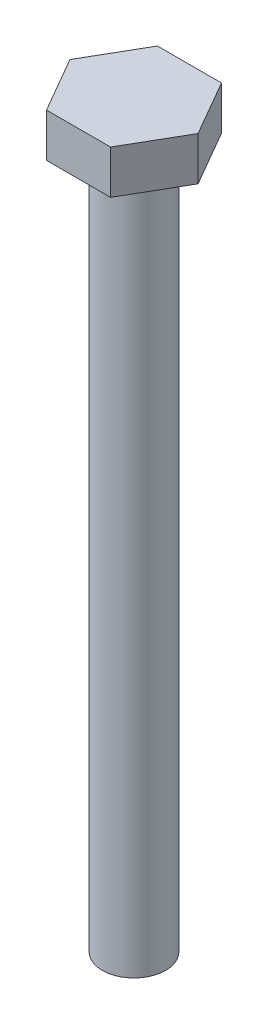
ISO-10303-21;
HEADER;
FILE_DESCRIPTION(('STEP AP214'),'2;1');
FILE_NAME('part.step','',(''),(''),'','','');
FILE_SCHEMA(('AUTOMOTIVE_DESIGN { 1 0 10303 214 1 1 1 1 }'));
ENDSEC;
DATA;
#1=APPLICATION_CONTEXT('core data for automotive mechanical design processes');
#2=APPLICATION_PROTOCOL_DEFINITION('international standard','automotive_design',2000,#1);
#3=PRODUCT_CONTEXT('',#1,'mechanical');
#4=PRODUCT('Part','Part','',(#3));
#5=PRODUCT_RELATED_PRODUCT_CATEGORY('part','',(#4));
#6=PRODUCT_DEFINITION_FORMATION('','',#4);
#7=PRODUCT_DEFINITION_CONTEXT('part definition',#1,'design');
#8=PRODUCT_DEFINITION('design','',#6,#7);
#9=PRODUCT_DEFINITION_SHAPE('','',#8);
#10=(LENGTH_UNIT() NAMED_UNIT(*) SI_UNIT(.MILLI.,.METRE.));
#11=(NAMED_UNIT(*) PLANE_ANGLE_UNIT() SI_UNIT($,.RADIAN.));
#12=(NAMED_UNIT(*) SI_UNIT($,.STERADIAN.) SOLID_ANGLE_UNIT());
#13=UNCERTAINTY_MEASURE_WITH_UNIT(LENGTH_MEASURE(1.E-05),#10,'distance_accuracy_value','');
#14=(GEOMETRIC_REPRESENTATION_CONTEXT(3) GLOBAL_UNCERTAINTY_ASSIGNED_CONTEXT((#13)) GLOBAL_UNIT_ASSIGNED_CONTEXT((#10,
#11,#12)) REPRESENTATION_CONTEXT('',''));
#15=CARTESIAN_POINT('',(0.,0.,0.));
#16=DIRECTION('',(0.,0.,1.));
#17=DIRECTION('',(1.,0.,0.));
#18=AXIS2_PLACEMENT_3D('',#15,#16,#17);
#19=CARTESIAN_POINT('',(0.,-69.85,0.));
#20=DIRECTION('',(0.,1.,0.));
#21=DIRECTION('',(0.,0.,1.));
#22=AXIS2_PLACEMENT_3D('',#19,#20,#21);
#23=CYLINDRICAL_SURFACE('',#22,3.175);
#24=CARTESIAN_POINT('',(0.,-69.85,0.));
#25=DIRECTION('',(0.,1.,0.));
#26=DIRECTION('',(0.,0.,1.));
#27=AXIS2_PLACEMENT_3D('',#24,#25,#26);
#28=CIRCLE('',#27,3.175);
#29=CARTESIAN_POINT('',(0.,-69.85,3.175));
#30=VERTEX_POINT('',#29);
#31=EDGE_CURVE('E11',#30,#30,#28,.T.);
#32=ORIENTED_EDGE('',*,*,#31,.T.);
#33=EDGE_LOOP('',(#32));
#34=FACE_BOUND('',#33,.T.);
#35=CARTESIAN_POINT('',(0.,0.,0.));
#36=DIRECTION('',(0.,1.,0.));
#37=DIRECTION('',(0.,0.,1.));
#38=AXIS2_PLACEMENT_3D('',#35,#36,#37);
#39=CIRCLE('',#38,3.175);
#40=CARTESIAN_POINT('',(0.,0.,3.175));
#41=VERTEX_POINT('',#40);
#42=EDGE_CURVE('E36',#41,#41,#39,.T.);
#43=ORIENTED_EDGE('',*,*,#42,.F.);
#44=EDGE_LOOP('',(#43));
#45=FACE_BOUND('',#44,.T.);
#46=ADVANCED_FACE('F33',(#34,#45),#23,.T.);
#47=CARTESIAN_POINT('',(0.,-69.85,0.));
#48=DIRECTION('',(0.,1.,0.));
#49=DIRECTION('',(0.,0.,1.));
#50=AXIS2_PLACEMENT_3D('',#47,#48,#49);
#51=PLANE('',#50);
#52=ORIENTED_EDGE('',*,*,#31,.F.);
#53=EDGE_LOOP('',(#52));
#54=FACE_BOUND('',#53,.T.);
#55=ADVANCED_FACE('F144',(#54),#51,.F.);
#56=CARTESIAN_POINT('',(-3.20790243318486,4.365625,5.55625));
#57=DIRECTION('',(0.,0.,-1.));
#58=DIRECTION('',(-1.,0.,0.));
#59=AXIS2_PLACEMENT_3D('',#56,#57,#58);
#60=PLANE('',#59);
#61=DIRECTION('',(1.,0.,0.));
#62=VECTOR('',#61,1.);
#63=CARTESIAN_POINT('',(-3.20790243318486,0.,5.55625));
#64=LINE('',#63,#62);
#65=CARTESIAN_POINT('',(-3.20790243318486,0.,5.55625));
#66=VERTEX_POINT('',#65);
#67=CARTESIAN_POINT('',(3.20790243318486,0.,5.55625));
#68=VERTEX_POINT('',#67);
#69=EDGE_CURVE('E118',#66,#68,#64,.T.);
#70=ORIENTED_EDGE('',*,*,#69,.T.);
#71=DIRECTION('',(0.,-1.,0.));
#72=VECTOR('',#71,1.);
#73=CARTESIAN_POINT('',(3.20790243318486,4.365625,5.55625));
#74=LINE('',#73,#72);
#75=CARTESIAN_POINT('',(3.20790243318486,4.365625,5.55625));
#76=VERTEX_POINT('',#75);
#77=EDGE_CURVE('E135',#76,#68,#74,.T.);
#78=ORIENTED_EDGE('',*,*,#77,.F.);
#79=DIRECTION('',(1.,0.,0.));
#80=VECTOR('',#79,1.);
#81=CARTESIAN_POINT('',(-3.20790243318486,4.365625,5.55625));
#82=LINE('',#81,#80);
#83=CARTESIAN_POINT('',(-3.20790243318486,4.365625,5.55625));
#84=VERTEX_POINT('',#83);
#85=EDGE_CURVE('E128',#84,#76,#82,.T.);
#86=ORIENTED_EDGE('',*,*,#85,.F.);
#87=DIRECTION('',(0.,-1.,0.));
#88=VECTOR('',#87,1.);
#89=CARTESIAN_POINT('',(-3.20790243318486,4.365625,5.55625));
#90=LINE('',#89,#88);
#91=EDGE_CURVE('E114',#84,#66,#90,.T.);
#92=ORIENTED_EDGE('',*,*,#91,.T.);
#93=EDGE_LOOP('',(#70,#78,#86,#92));
#94=FACE_BOUND('',#93,.T.);
#95=ADVANCED_FACE('F149',(#94),#60,.F.);
#96=CARTESIAN_POINT('',(3.20790243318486,4.365625,5.55625));
#97=DIRECTION('',(-0.866025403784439,0.,-0.499999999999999));
#98=DIRECTION('',(-0.499999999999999,0.,0.866025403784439));
#99=AXIS2_PLACEMENT_3D('',#96,#97,#98);
#100=PLANE('',#99);
#101=DIRECTION('',(0.499999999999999,0.,-0.866025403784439));
#102=VECTOR('',#101,1.);
#103=CARTESIAN_POINT('',(3.20790243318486,0.,5.55625));
#104=LINE('',#103,#102);
#105=CARTESIAN_POINT('',(6.41580486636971,0.,0.));
#106=VERTEX_POINT('',#105);
#107=EDGE_CURVE('E121',#68,#106,#104,.T.);
#108=ORIENTED_EDGE('',*,*,#107,.T.);
#109=DIRECTION('',(0.,-1.,0.));
#110=VECTOR('',#109,1.);
#111=CARTESIAN_POINT('',(6.41580486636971,4.365625,0.));
#112=LINE('',#111,#110);
#113=CARTESIAN_POINT('',(6.41580486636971,4.365625,0.));
#114=VERTEX_POINT('',#113);
#115=EDGE_CURVE('E132',#114,#106,#112,.T.);
#116=ORIENTED_EDGE('',*,*,#115,.F.);
#117=DIRECTION('',(0.499999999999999,0.,-0.866025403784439));
#118=VECTOR('',#117,1.);
#119=CARTESIAN_POINT('',(3.20790243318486,4.365625,5.55625));
#120=LINE('',#119,#118);
#121=EDGE_CURVE('E87',#76,#114,#120,.T.);
#122=ORIENTED_EDGE('',*,*,#121,.F.);
#123=ORIENTED_EDGE('',*,*,#77,.T.);
#124=EDGE_LOOP('',(#108,#116,#122,#123));
#125=FACE_BOUND('',#124,.T.);
#126=ADVANCED_FACE('F155',(#125),#100,.F.);
#127=CARTESIAN_POINT('',(6.41580486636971,4.365625,0.));
#128=DIRECTION('',(-0.866025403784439,0.,0.5));
#129=DIRECTION('',(0.5,0.,0.866025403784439));
#130=AXIS2_PLACEMENT_3D('',#127,#128,#129);
#131=PLANE('',#130);
#132=DIRECTION('',(-0.5,0.,-0.866025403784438));
#133=VECTOR('',#132,1.);
#134=CARTESIAN_POINT('',(6.41580486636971,0.,0.));
#135=LINE('',#134,#133);
#136=CARTESIAN_POINT('',(3.20790243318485,0.,-5.55625000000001));
#137=VERTEX_POINT('',#136);
#138=EDGE_CURVE('E123',#106,#137,#135,.T.);
#139=ORIENTED_EDGE('',*,*,#138,.T.);
#140=DIRECTION('',(0.,-1.,0.));
#141=VECTOR('',#140,1.);
#142=CARTESIAN_POINT('',(3.20790243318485,4.365625,-5.55625000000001));
#143=LINE('',#142,#141);
#144=CARTESIAN_POINT('',(3.20790243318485,4.365625,-5.55625000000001));
#145=VERTEX_POINT('',#144);
#146=EDGE_CURVE('E109',#145,#137,#143,.T.);
#147=ORIENTED_EDGE('',*,*,#146,.F.);
#148=DIRECTION('',(-0.5,0.,-0.866025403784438));
#149=VECTOR('',#148,1.);
#150=CARTESIAN_POINT('',(6.41580486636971,4.365625,0.));
#151=LINE('',#150,#149);
#152=EDGE_CURVE('E100',#114,#145,#151,.T.);
#153=ORIENTED_EDGE('',*,*,#152,.F.);
#154=ORIENTED_EDGE('',*,*,#115,.T.);
#155=EDGE_LOOP('',(#139,#147,#153,#154));
#156=FACE_BOUND('',#155,.T.);
#157=ADVANCED_FACE('F161',(#156),#131,.F.);
#158=CARTESIAN_POINT('',(3.20790243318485,4.365625,-5.55625000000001));
#159=DIRECTION('',(0.,0.,1.));
#160=DIRECTION('',(1.,0.,0.));
#161=AXIS2_PLACEMENT_3D('',#158,#159,#160);
#162=PLANE('',#161);
#163=DIRECTION('',(-1.,0.,0.));
#164=VECTOR('',#163,1.);
#165=CARTESIAN_POINT('',(3.20790243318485,0.,-5.55625000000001));
#166=LINE('',#165,#164);
#167=CARTESIAN_POINT('',(-3.20790243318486,0.,-5.55625000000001));
#168=VERTEX_POINT('',#167);
#169=EDGE_CURVE('E108',#137,#168,#166,.T.);
#170=ORIENTED_EDGE('',*,*,#169,.T.);
#171=DIRECTION('',(0.,-1.,0.));
#172=VECTOR('',#171,1.);
#173=CARTESIAN_POINT('',(-3.20790243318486,4.365625,-5.55625000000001));
#174=LINE('',#173,#172);
#175=CARTESIAN_POINT('',(-3.20790243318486,4.365625,-5.55625000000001));
#176=VERTEX_POINT('',#175);
#177=EDGE_CURVE('E105',#176,#168,#174,.T.);
#178=ORIENTED_EDGE('',*,*,#177,.F.);
#179=DIRECTION('',(-1.,0.,0.));
#180=VECTOR('',#179,1.);
#181=CARTESIAN_POINT('',(3.20790243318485,4.365625,-5.55625000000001));
#182=LINE('',#181,#180);
#183=EDGE_CURVE('E94',#145,#176,#182,.T.);
#184=ORIENTED_EDGE('',*,*,#183,.F.);
#185=ORIENTED_EDGE('',*,*,#146,.T.);
#186=EDGE_LOOP('',(#170,#178,#184,#185));
#187=FACE_BOUND('',#186,.T.);
#188=ADVANCED_FACE('F106',(#187),#162,.F.);
#189=CARTESIAN_POINT('',(-3.20790243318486,4.365625,-5.55625000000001));
#190=DIRECTION('',(0.866025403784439,0.,0.5));
#191=DIRECTION('',(0.5,0.,-0.866025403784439));
#192=AXIS2_PLACEMENT_3D('',#189,#190,#191);
#193=PLANE('',#192);
#194=DIRECTION('',(-0.5,0.,0.866025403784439));
#195=VECTOR('',#194,1.);
#196=CARTESIAN_POINT('',(-3.20790243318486,0.,-5.55625000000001));
#197=LINE('',#196,#195);
#198=CARTESIAN_POINT('',(-6.41580486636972,0.,0.));
#199=VERTEX_POINT('',#198);
#200=EDGE_CURVE('E72',#168,#199,#197,.T.);
#201=ORIENTED_EDGE('',*,*,#200,.T.);
#202=DIRECTION('',(0.,-1.,0.));
#203=VECTOR('',#202,1.);
#204=CARTESIAN_POINT('',(-6.41580486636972,4.365625,0.));
#205=LINE('',#204,#203);
#206=CARTESIAN_POINT('',(-6.41580486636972,4.365625,0.));
#207=VERTEX_POINT('',#206);
#208=EDGE_CURVE('E110',#207,#199,#205,.T.);
#209=ORIENTED_EDGE('',*,*,#208,.F.);
#210=DIRECTION('',(-0.5,0.,0.866025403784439));
#211=VECTOR('',#210,1.);
#212=CARTESIAN_POINT('',(-3.20790243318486,4.365625,-5.55625000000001));
#213=LINE('',#212,#211);
#214=EDGE_CURVE('E98',#176,#207,#213,.T.);
#215=ORIENTED_EDGE('',*,*,#214,.F.);
#216=ORIENTED_EDGE('',*,*,#177,.T.);
#217=EDGE_LOOP('',(#201,#209,#215,#216));
#218=FACE_BOUND('',#217,.T.);
#219=ADVANCED_FACE('F112',(#218),#193,.F.);
#220=CARTESIAN_POINT('',(-6.41580486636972,4.365625,0.));
#221=DIRECTION('',(0.866025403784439,0.,-0.5));
#222=DIRECTION('',(-0.5,0.,-0.866025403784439));
#223=AXIS2_PLACEMENT_3D('',#220,#221,#222);
#224=PLANE('',#223);
#225=DIRECTION('',(0.5,0.,0.866025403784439));
#226=VECTOR('',#225,1.);
#227=CARTESIAN_POINT('',(-6.41580486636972,0.,0.));
#228=LINE('',#227,#226);
#229=EDGE_CURVE('E78',#199,#66,#228,.T.);
#230=ORIENTED_EDGE('',*,*,#229,.T.);
#231=ORIENTED_EDGE('',*,*,#91,.F.);
#232=DIRECTION('',(0.5,0.,0.866025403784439));
#233=VECTOR('',#232,1.);
#234=CARTESIAN_POINT('',(-6.41580486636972,4.365625,0.));
#235=LINE('',#234,#233);
#236=EDGE_CURVE('E49',#207,#84,#235,.T.);
#237=ORIENTED_EDGE('',*,*,#236,.F.);
#238=ORIENTED_EDGE('',*,*,#208,.T.);
#239=EDGE_LOOP('',(#230,#231,#237,#238));
#240=FACE_BOUND('',#239,.T.);
#241=ADVANCED_FACE('F169',(#240),#224,.F.);
#242=CARTESIAN_POINT('',(0.,4.365625,0.));
#243=DIRECTION('',(0.,1.,0.));
#244=DIRECTION('',(0.,0.,1.));
#245=AXIS2_PLACEMENT_3D('',#242,#243,#244);
#246=PLANE('',#245);
#247=ORIENTED_EDGE('',*,*,#85,.T.);
#248=ORIENTED_EDGE('',*,*,#121,.T.);
#249=ORIENTED_EDGE('',*,*,#152,.T.);
#250=ORIENTED_EDGE('',*,*,#183,.T.);
#251=ORIENTED_EDGE('',*,*,#214,.T.);
#252=ORIENTED_EDGE('',*,*,#236,.T.);
#253=EDGE_LOOP('',(#247,#248,#249,#250,#251,#252));
#254=FACE_BOUND('',#253,.T.);
#255=ADVANCED_FACE('F96',(#254),#246,.T.);
#256=CARTESIAN_POINT('',(0.,0.,0.));
#257=DIRECTION('',(0.,1.,0.));
#258=DIRECTION('',(0.,0.,1.));
#259=AXIS2_PLACEMENT_3D('',#256,#257,#258);
#260=PLANE('',#259);
#261=ORIENTED_EDGE('',*,*,#42,.T.);
#262=EDGE_LOOP('',(#261));
#263=FACE_BOUND('',#262,.T.);
#264=ORIENTED_EDGE('',*,*,#69,.F.);
#265=ORIENTED_EDGE('',*,*,#229,.F.);
#266=ORIENTED_EDGE('',*,*,#200,.F.);
#267=ORIENTED_EDGE('',*,*,#169,.F.);
#268=ORIENTED_EDGE('',*,*,#138,.F.);
#269=ORIENTED_EDGE('',*,*,#107,.F.);
#270=EDGE_LOOP('',(#264,#265,#266,#267,#268,#269));
#271=FACE_BOUND('',#270,.T.);
#272=ADVANCED_FACE('F140',(#263,#271),#260,.F.);
#273=CLOSED_SHELL('',(#46,#55,#95,#126,#157,#188,#219,#241,#255,#272));
#274=MANIFOLD_SOLID_BREP('B2',#273);
#275=ADVANCED_BREP_SHAPE_REPRESENTATION('',(#18,#274),#14);
#276=SHAPE_DEFINITION_REPRESENTATION(#9,#275);
ENDSEC;
END-ISO-10303-21;
